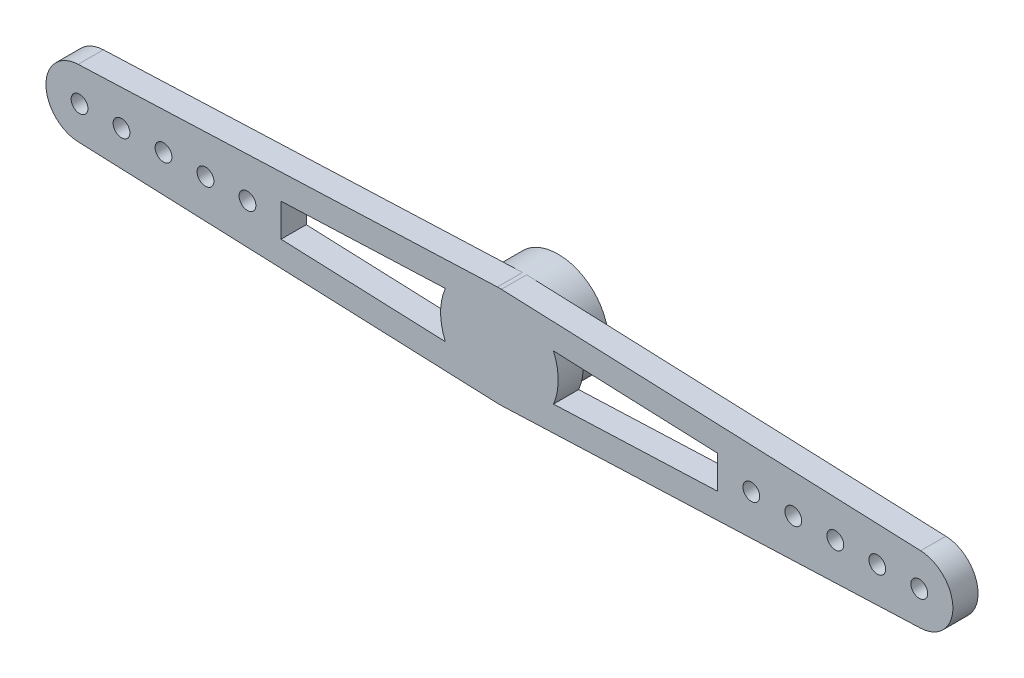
ISO-10303-21;
HEADER;
FILE_DESCRIPTION(('STEP AP214'),'2;1');
FILE_NAME('part.step','',(''),(''),'','','');
FILE_SCHEMA(('AUTOMOTIVE_DESIGN { 1 0 10303 214 1 1 1 1 }'));
ENDSEC;
DATA;
#1=APPLICATION_CONTEXT('core data for automotive mechanical design processes');
#2=APPLICATION_PROTOCOL_DEFINITION('international standard','automotive_design',2000,#1);
#3=PRODUCT_CONTEXT('',#1,'mechanical');
#4=PRODUCT('Part','Part','',(#3));
#5=PRODUCT_RELATED_PRODUCT_CATEGORY('part','',(#4));
#6=PRODUCT_DEFINITION_FORMATION('','',#4);
#7=PRODUCT_DEFINITION_CONTEXT('part definition',#1,'design');
#8=PRODUCT_DEFINITION('design','',#6,#7);
#9=PRODUCT_DEFINITION_SHAPE('','',#8);
#10=(LENGTH_UNIT() NAMED_UNIT(*) SI_UNIT(.MILLI.,.METRE.));
#11=(NAMED_UNIT(*) PLANE_ANGLE_UNIT() SI_UNIT($,.RADIAN.));
#12=(NAMED_UNIT(*) SI_UNIT($,.STERADIAN.) SOLID_ANGLE_UNIT());
#13=UNCERTAINTY_MEASURE_WITH_UNIT(LENGTH_MEASURE(1.E-05),#10,'distance_accuracy_value','');
#14=(GEOMETRIC_REPRESENTATION_CONTEXT(3) GLOBAL_UNCERTAINTY_ASSIGNED_CONTEXT((#13)) GLOBAL_UNIT_ASSIGNED_CONTEXT((#10,
#11,#12)) REPRESENTATION_CONTEXT('',''));
#15=CARTESIAN_POINT('',(0.,0.,0.));
#16=DIRECTION('',(0.,0.,1.));
#17=DIRECTION('',(1.,0.,0.));
#18=AXIS2_PLACEMENT_3D('',#15,#16,#17);
#19=CARTESIAN_POINT('',(0.,0.,0.));
#20=DIRECTION('',(0.,0.,1.));
#21=DIRECTION('',(1.,0.,0.));
#22=AXIS2_PLACEMENT_3D('',#19,#20,#21);
#23=PLANE('',#22);
#24=DIRECTION('',(0.,-1.,0.));
#25=VECTOR('',#24,1.);
#26=CARTESIAN_POINT('',(-13.,0.980784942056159,0.));
#27=LINE('',#26,#25);
#28=CARTESIAN_POINT('',(-13.,0.980784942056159,0.));
#29=VERTEX_POINT('',#28);
#30=CARTESIAN_POINT('',(-13.,-0.980784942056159,0.));
#31=VERTEX_POINT('',#30);
#32=EDGE_CURVE('E57',#29,#31,#27,.T.);
#33=ORIENTED_EDGE('',*,*,#32,.T.);
#34=DIRECTION('',(0.999199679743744,-0.04,0.));
#35=VECTOR('',#34,1.);
#36=CARTESIAN_POINT('',(-13.,-0.980784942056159,0.));
#37=LINE('',#36,#35);
#38=CARTESIAN_POINT('',(-3.21974682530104,-1.37230841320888,0.));
#39=VERTEX_POINT('',#38);
#40=EDGE_CURVE('E346',#31,#39,#37,.T.);
#41=ORIENTED_EDGE('',*,*,#40,.T.);
#42=CARTESIAN_POINT('',(0.,0.,0.));
#43=DIRECTION('',(0.,0.,-1.));
#44=DIRECTION('',(1.,0.,0.));
#45=AXIS2_PLACEMENT_3D('',#42,#43,#44);
#46=CIRCLE('',#45,3.5);
#47=CARTESIAN_POINT('',(-3.21974682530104,1.37230841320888,0.));
#48=VERTEX_POINT('',#47);
#49=EDGE_CURVE('E343',#39,#48,#46,.T.);
#50=ORIENTED_EDGE('',*,*,#49,.T.);
#51=DIRECTION('',(-0.999199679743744,-0.0399999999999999,0.));
#52=VECTOR('',#51,1.);
#53=CARTESIAN_POINT('',(-13.,0.980784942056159,0.));
#54=LINE('',#53,#52);
#55=EDGE_CURVE('E339',#48,#29,#54,.T.);
#56=ORIENTED_EDGE('',*,*,#55,.T.);
#57=EDGE_LOOP('',(#33,#41,#50,#56));
#58=FACE_BOUND('',#57,.T.);
#59=CARTESIAN_POINT('',(-15.,0.,0.));
#60=DIRECTION('',(0.,0.,1.));
#61=DIRECTION('',(1.,0.,0.));
#62=AXIS2_PLACEMENT_3D('',#59,#60,#61);
#63=CIRCLE('',#62,0.500000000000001);
#64=CARTESIAN_POINT('',(-14.5,0.,0.));
#65=VERTEX_POINT('',#64);
#66=EDGE_CURVE('E283',#65,#65,#63,.T.);
#67=ORIENTED_EDGE('',*,*,#66,.T.);
#68=EDGE_LOOP('',(#67));
#69=FACE_BOUND('',#68,.T.);
#70=CARTESIAN_POINT('',(-20.,0.,0.));
#71=DIRECTION('',(0.,0.,1.));
#72=DIRECTION('',(1.,0.,0.));
#73=AXIS2_PLACEMENT_3D('',#70,#71,#72);
#74=CIRCLE('',#73,0.499999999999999);
#75=CARTESIAN_POINT('',(-19.5,0.,0.));
#76=VERTEX_POINT('',#75);
#77=EDGE_CURVE('E259',#76,#76,#74,.T.);
#78=ORIENTED_EDGE('',*,*,#77,.T.);
#79=EDGE_LOOP('',(#78));
#80=FACE_BOUND('',#79,.T.);
#81=CARTESIAN_POINT('',(-25.,0.,0.));
#82=DIRECTION('',(0.,0.,1.));
#83=DIRECTION('',(1.,0.,0.));
#84=AXIS2_PLACEMENT_3D('',#81,#82,#83);
#85=CIRCLE('',#84,0.499999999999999);
#86=CARTESIAN_POINT('',(-24.5,0.,0.));
#87=VERTEX_POINT('',#86);
#88=EDGE_CURVE('E247',#87,#87,#85,.T.);
#89=ORIENTED_EDGE('',*,*,#88,.T.);
#90=EDGE_LOOP('',(#89));
#91=FACE_BOUND('',#90,.T.);
#92=CARTESIAN_POINT('',(-17.5,0.,0.));
#93=DIRECTION('',(0.,0.,1.));
#94=DIRECTION('',(1.,0.,0.));
#95=AXIS2_PLACEMENT_3D('',#92,#93,#94);
#96=CIRCLE('',#95,0.499999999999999);
#97=CARTESIAN_POINT('',(-17.,0.,0.));
#98=VERTEX_POINT('',#97);
#99=EDGE_CURVE('E241',#98,#98,#96,.T.);
#100=ORIENTED_EDGE('',*,*,#99,.T.);
#101=EDGE_LOOP('',(#100));
#102=FACE_BOUND('',#101,.T.);
#103=CARTESIAN_POINT('',(-22.5,0.,0.));
#104=DIRECTION('',(0.,0.,1.));
#105=DIRECTION('',(1.,0.,0.));
#106=AXIS2_PLACEMENT_3D('',#103,#104,#105);
#107=CIRCLE('',#106,0.499999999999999);
#108=CARTESIAN_POINT('',(-22.,0.,0.));
#109=VERTEX_POINT('',#108);
#110=EDGE_CURVE('E253',#109,#109,#107,.T.);
#111=ORIENTED_EDGE('',*,*,#110,.T.);
#112=EDGE_LOOP('',(#111));
#113=FACE_BOUND('',#112,.T.);
#114=DIRECTION('',(-0.999199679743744,-0.04,0.));
#115=VECTOR('',#114,1.);
#116=CARTESIAN_POINT('',(-25.08,1.99839935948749,0.));
#117=LINE('',#116,#115);
#118=CARTESIAN_POINT('',(-0.12,2.99759903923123,0.));
#119=VERTEX_POINT('',#118);
#120=CARTESIAN_POINT('',(-25.08,1.99839935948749,0.));
#121=VERTEX_POINT('',#120);
#122=EDGE_CURVE('E153',#119,#121,#117,.T.);
#123=ORIENTED_EDGE('',*,*,#122,.F.);
#124=CARTESIAN_POINT('',(0.,0.,0.));
#125=DIRECTION('',(0.,0.,1.));
#126=DIRECTION('',(1.,0.,0.));
#127=AXIS2_PLACEMENT_3D('',#124,#125,#126);
#128=CIRCLE('',#127,3.);
#129=CARTESIAN_POINT('',(-0.12,-2.99759903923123,0.));
#130=VERTEX_POINT('',#129);
#131=EDGE_CURVE('E149',#119,#130,#128,.T.);
#132=ORIENTED_EDGE('',*,*,#131,.T.);
#133=DIRECTION('',(0.999199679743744,-0.04,0.));
#134=VECTOR('',#133,1.);
#135=CARTESIAN_POINT('',(-25.08,-1.99839935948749,0.));
#136=LINE('',#135,#134);
#137=CARTESIAN_POINT('',(-25.08,-1.99839935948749,0.));
#138=VERTEX_POINT('',#137);
#139=EDGE_CURVE('E152',#138,#130,#136,.T.);
#140=ORIENTED_EDGE('',*,*,#139,.F.);
#141=CARTESIAN_POINT('',(-25.,0.,0.));
#142=DIRECTION('',(0.,0.,1.));
#143=DIRECTION('',(1.,0.,0.));
#144=AXIS2_PLACEMENT_3D('',#141,#142,#143);
#145=CIRCLE('',#144,2.);
#146=EDGE_CURVE('E171',#121,#138,#145,.T.);
#147=ORIENTED_EDGE('',*,*,#146,.F.);
#148=EDGE_LOOP('',(#123,#132,#140,#147));
#149=FACE_BOUND('',#148,.T.);
#150=ADVANCED_FACE('F34',(#58,#69,#80,#91,#102,#113,#149),#23,.F.);
#151=CARTESIAN_POINT('',(0.,0.,1.5));
#152=DIRECTION('',(0.,0.,1.));
#153=DIRECTION('',(1.,0.,0.));
#154=AXIS2_PLACEMENT_3D('',#151,#152,#153);
#155=PLANE('',#154);
#156=DIRECTION('',(-0.999199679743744,0.04,0.));
#157=VECTOR('',#156,1.);
#158=CARTESIAN_POINT('',(0.12,2.99759903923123,1.5));
#159=LINE('',#158,#157);
#160=CARTESIAN_POINT('',(25.08,1.99839935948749,1.5));
#161=VERTEX_POINT('',#160);
#162=CARTESIAN_POINT('',(0.12,2.99759903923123,1.5));
#163=VERTEX_POINT('',#162);
#164=EDGE_CURVE('E229',#161,#163,#159,.T.);
#165=ORIENTED_EDGE('',*,*,#164,.T.);
#166=CARTESIAN_POINT('',(0.,0.,1.5));
#167=DIRECTION('',(0.,0.,1.));
#168=DIRECTION('',(1.,0.,0.));
#169=AXIS2_PLACEMENT_3D('',#166,#167,#168);
#170=CIRCLE('',#169,3.);
#171=CARTESIAN_POINT('',(-0.12,2.99759903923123,1.5));
#172=VERTEX_POINT('',#171);
#173=EDGE_CURVE('E226',#163,#172,#170,.T.);
#174=ORIENTED_EDGE('',*,*,#173,.T.);
#175=DIRECTION('',(-0.999199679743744,-0.04,0.));
#176=VECTOR('',#175,1.);
#177=CARTESIAN_POINT('',(-25.08,1.99839935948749,1.5));
#178=LINE('',#177,#176);
#179=CARTESIAN_POINT('',(-25.08,1.99839935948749,1.5));
#180=VERTEX_POINT('',#179);
#181=EDGE_CURVE('E224',#172,#180,#178,.T.);
#182=ORIENTED_EDGE('',*,*,#181,.T.);
#183=CARTESIAN_POINT('',(-25.,0.,1.5));
#184=DIRECTION('',(0.,0.,1.));
#185=DIRECTION('',(1.,0.,0.));
#186=AXIS2_PLACEMENT_3D('',#183,#184,#185);
#187=CIRCLE('',#186,2.);
#188=CARTESIAN_POINT('',(-25.08,-1.99839935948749,1.5));
#189=VERTEX_POINT('',#188);
#190=EDGE_CURVE('E182',#180,#189,#187,.T.);
#191=ORIENTED_EDGE('',*,*,#190,.T.);
#192=DIRECTION('',(0.999199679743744,-0.04,0.));
#193=VECTOR('',#192,1.);
#194=CARTESIAN_POINT('',(-25.08,-1.99839935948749,1.5));
#195=LINE('',#194,#193);
#196=CARTESIAN_POINT('',(-0.12,-2.99759903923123,1.5));
#197=VERTEX_POINT('',#196);
#198=EDGE_CURVE('E178',#189,#197,#195,.T.);
#199=ORIENTED_EDGE('',*,*,#198,.T.);
#200=CARTESIAN_POINT('',(0.,0.,1.5));
#201=DIRECTION('',(0.,0.,1.));
#202=DIRECTION('',(1.,0.,0.));
#203=AXIS2_PLACEMENT_3D('',#200,#201,#202);
#204=CIRCLE('',#203,3.);
#205=CARTESIAN_POINT('',(0.12,-2.99759903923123,1.5));
#206=VERTEX_POINT('',#205);
#207=EDGE_CURVE('E170',#197,#206,#204,.T.);
#208=ORIENTED_EDGE('',*,*,#207,.T.);
#209=DIRECTION('',(0.999199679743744,0.04,0.));
#210=VECTOR('',#209,1.);
#211=CARTESIAN_POINT('',(25.08,-1.99839935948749,1.5));
#212=LINE('',#211,#210);
#213=CARTESIAN_POINT('',(25.08,-1.99839935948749,1.5));
#214=VERTEX_POINT('',#213);
#215=EDGE_CURVE('E237',#206,#214,#212,.T.);
#216=ORIENTED_EDGE('',*,*,#215,.T.);
#217=CARTESIAN_POINT('',(25.,0.,1.5));
#218=DIRECTION('',(0.,0.,1.));
#219=DIRECTION('',(1.,0.,0.));
#220=AXIS2_PLACEMENT_3D('',#217,#218,#219);
#221=CIRCLE('',#220,2.);
#222=EDGE_CURVE('E202',#214,#161,#221,.T.);
#223=ORIENTED_EDGE('',*,*,#222,.T.);
#224=EDGE_LOOP('',(#165,#174,#182,#191,#199,#208,#216,#223));
#225=FACE_BOUND('',#224,.T.);
#226=DIRECTION('',(0.999199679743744,0.04,0.));
#227=VECTOR('',#226,1.);
#228=CARTESIAN_POINT('',(13.,-0.980784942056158,1.5));
#229=LINE('',#228,#227);
#230=CARTESIAN_POINT('',(3.21974682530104,-1.37230841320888,1.5));
#231=VERTEX_POINT('',#230);
#232=CARTESIAN_POINT('',(13.,-0.980784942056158,1.5));
#233=VERTEX_POINT('',#232);
#234=EDGE_CURVE('E329',#231,#233,#229,.T.);
#235=ORIENTED_EDGE('',*,*,#234,.F.);
#236=CARTESIAN_POINT('',(0.,0.,1.5));
#237=DIRECTION('',(0.,0.,-1.));
#238=DIRECTION('',(1.,0.,0.));
#239=AXIS2_PLACEMENT_3D('',#236,#237,#238);
#240=CIRCLE('',#239,3.5);
#241=CARTESIAN_POINT('',(3.21974682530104,1.37230841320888,1.5));
#242=VERTEX_POINT('',#241);
#243=EDGE_CURVE('E314',#242,#231,#240,.T.);
#244=ORIENTED_EDGE('',*,*,#243,.F.);
#245=DIRECTION('',(-0.999199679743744,0.0400000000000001,0.));
#246=VECTOR('',#245,1.);
#247=CARTESIAN_POINT('',(3.21974682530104,1.37230841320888,1.5));
#248=LINE('',#247,#246);
#249=CARTESIAN_POINT('',(13.,0.980784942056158,1.5));
#250=VERTEX_POINT('',#249);
#251=EDGE_CURVE('E310',#250,#242,#248,.T.);
#252=ORIENTED_EDGE('',*,*,#251,.F.);
#253=DIRECTION('',(0.,1.,0.));
#254=VECTOR('',#253,1.);
#255=CARTESIAN_POINT('',(13.,-0.980784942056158,1.5));
#256=LINE('',#255,#254);
#257=EDGE_CURVE('E326',#233,#250,#256,.T.);
#258=ORIENTED_EDGE('',*,*,#257,.F.);
#259=EDGE_LOOP('',(#235,#244,#252,#258));
#260=FACE_BOUND('',#259,.T.);
#261=CARTESIAN_POINT('',(17.5,0.,1.5));
#262=DIRECTION('',(0.,0.,1.));
#263=DIRECTION('',(1.,0.,0.));
#264=AXIS2_PLACEMENT_3D('',#261,#262,#263);
#265=CIRCLE('',#264,0.499999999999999);
#266=CARTESIAN_POINT('',(18.,0.,1.5));
#267=VERTEX_POINT('',#266);
#268=EDGE_CURVE('E286',#267,#267,#265,.T.);
#269=ORIENTED_EDGE('',*,*,#268,.F.);
#270=EDGE_LOOP('',(#269));
#271=FACE_BOUND('',#270,.T.);
#272=CARTESIAN_POINT('',(25.,0.,1.5));
#273=DIRECTION('',(0.,0.,1.));
#274=DIRECTION('',(1.,0.,0.));
#275=AXIS2_PLACEMENT_3D('',#272,#273,#274);
#276=CIRCLE('',#275,0.499999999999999);
#277=CARTESIAN_POINT('',(25.5,0.,1.5));
#278=VERTEX_POINT('',#277);
#279=EDGE_CURVE('E274',#278,#278,#276,.T.);
#280=ORIENTED_EDGE('',*,*,#279,.F.);
#281=EDGE_LOOP('',(#280));
#282=FACE_BOUND('',#281,.T.);
#283=CARTESIAN_POINT('',(20.,0.,1.5));
#284=DIRECTION('',(0.,0.,1.));
#285=DIRECTION('',(1.,0.,0.));
#286=AXIS2_PLACEMENT_3D('',#283,#284,#285);
#287=CIRCLE('',#286,0.499999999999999);
#288=CARTESIAN_POINT('',(20.5,0.,1.5));
#289=VERTEX_POINT('',#288);
#290=EDGE_CURVE('E262',#289,#289,#287,.T.);
#291=ORIENTED_EDGE('',*,*,#290,.F.);
#292=EDGE_LOOP('',(#291));
#293=FACE_BOUND('',#292,.T.);
#294=CARTESIAN_POINT('',(22.5,0.,1.5));
#295=DIRECTION('',(0.,0.,1.));
#296=DIRECTION('',(1.,0.,0.));
#297=AXIS2_PLACEMENT_3D('',#294,#295,#296);
#298=CIRCLE('',#297,0.499999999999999);
#299=CARTESIAN_POINT('',(23.,0.,1.5));
#300=VERTEX_POINT('',#299);
#301=EDGE_CURVE('E268',#300,#300,#298,.T.);
#302=ORIENTED_EDGE('',*,*,#301,.F.);
#303=EDGE_LOOP('',(#302));
#304=FACE_BOUND('',#303,.T.);
#305=CARTESIAN_POINT('',(15.,0.,1.5));
#306=DIRECTION('',(0.,0.,1.));
#307=DIRECTION('',(1.,0.,0.));
#308=AXIS2_PLACEMENT_3D('',#305,#306,#307);
#309=CIRCLE('',#308,0.500000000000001);
#310=CARTESIAN_POINT('',(15.5,0.,1.5));
#311=VERTEX_POINT('',#310);
#312=EDGE_CURVE('E292',#311,#311,#309,.T.);
#313=ORIENTED_EDGE('',*,*,#312,.F.);
#314=EDGE_LOOP('',(#313));
#315=FACE_BOUND('',#314,.T.);
#316=DIRECTION('',(0.999199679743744,-0.04,0.));
#317=VECTOR('',#316,1.);
#318=CARTESIAN_POINT('',(-13.,-0.980784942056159,1.5));
#319=LINE('',#318,#317);
#320=CARTESIAN_POINT('',(-13.,-0.980784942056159,1.5));
#321=VERTEX_POINT('',#320);
#322=CARTESIAN_POINT('',(-3.21974682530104,-1.37230841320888,1.5));
#323=VERTEX_POINT('',#322);
#324=EDGE_CURVE('E353',#321,#323,#319,.T.);
#325=ORIENTED_EDGE('',*,*,#324,.F.);
#326=DIRECTION('',(0.,-1.,0.));
#327=VECTOR('',#326,1.);
#328=CARTESIAN_POINT('',(-13.,0.980784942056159,1.5));
#329=LINE('',#328,#327);
#330=CARTESIAN_POINT('',(-13.,0.980784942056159,1.5));
#331=VERTEX_POINT('',#330);
#332=EDGE_CURVE('E342',#331,#321,#329,.T.);
#333=ORIENTED_EDGE('',*,*,#332,.F.);
#334=DIRECTION('',(-0.999199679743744,-0.0399999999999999,0.));
#335=VECTOR('',#334,1.);
#336=CARTESIAN_POINT('',(-13.,0.980784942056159,1.5));
#337=LINE('',#336,#335);
#338=CARTESIAN_POINT('',(-3.21974682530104,1.37230841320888,1.5));
#339=VERTEX_POINT('',#338);
#340=EDGE_CURVE('E338',#339,#331,#337,.T.);
#341=ORIENTED_EDGE('',*,*,#340,.F.);
#342=CARTESIAN_POINT('',(0.,0.,1.5));
#343=DIRECTION('',(0.,0.,-1.));
#344=DIRECTION('',(1.,0.,0.));
#345=AXIS2_PLACEMENT_3D('',#342,#343,#344);
#346=CIRCLE('',#345,3.5);
#347=EDGE_CURVE('E351',#323,#339,#346,.T.);
#348=ORIENTED_EDGE('',*,*,#347,.F.);
#349=EDGE_LOOP('',(#325,#333,#341,#348));
#350=FACE_BOUND('',#349,.T.);
#351=CARTESIAN_POINT('',(-15.,0.,1.5));
#352=DIRECTION('',(0.,0.,1.));
#353=DIRECTION('',(1.,0.,0.));
#354=AXIS2_PLACEMENT_3D('',#351,#352,#353);
#355=CIRCLE('',#354,0.500000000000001);
#356=CARTESIAN_POINT('',(-14.5,0.,1.5));
#357=VERTEX_POINT('',#356);
#358=EDGE_CURVE('E280',#357,#357,#355,.T.);
#359=ORIENTED_EDGE('',*,*,#358,.F.);
#360=EDGE_LOOP('',(#359));
#361=FACE_BOUND('',#360,.T.);
#362=CARTESIAN_POINT('',(-20.,0.,1.5));
#363=DIRECTION('',(0.,0.,1.));
#364=DIRECTION('',(1.,0.,0.));
#365=AXIS2_PLACEMENT_3D('',#362,#363,#364);
#366=CIRCLE('',#365,0.499999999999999);
#367=CARTESIAN_POINT('',(-19.5,0.,1.5));
#368=VERTEX_POINT('',#367);
#369=EDGE_CURVE('E256',#368,#368,#366,.T.);
#370=ORIENTED_EDGE('',*,*,#369,.F.);
#371=EDGE_LOOP('',(#370));
#372=FACE_BOUND('',#371,.T.);
#373=CARTESIAN_POINT('',(-25.,0.,1.5));
#374=DIRECTION('',(0.,0.,1.));
#375=DIRECTION('',(1.,0.,0.));
#376=AXIS2_PLACEMENT_3D('',#373,#374,#375);
#377=CIRCLE('',#376,0.499999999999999);
#378=CARTESIAN_POINT('',(-24.5,0.,1.5));
#379=VERTEX_POINT('',#378);
#380=EDGE_CURVE('E244',#379,#379,#377,.T.);
#381=ORIENTED_EDGE('',*,*,#380,.F.);
#382=EDGE_LOOP('',(#381));
#383=FACE_BOUND('',#382,.T.);
#384=CARTESIAN_POINT('',(-17.5,0.,1.5));
#385=DIRECTION('',(0.,0.,1.));
#386=DIRECTION('',(1.,0.,0.));
#387=AXIS2_PLACEMENT_3D('',#384,#385,#386);
#388=CIRCLE('',#387,0.499999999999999);
#389=CARTESIAN_POINT('',(-17.,0.,1.5));
#390=VERTEX_POINT('',#389);
#391=EDGE_CURVE('E214',#390,#390,#388,.T.);
#392=ORIENTED_EDGE('',*,*,#391,.F.);
#393=EDGE_LOOP('',(#392));
#394=FACE_BOUND('',#393,.T.);
#395=CARTESIAN_POINT('',(-22.5,0.,1.5));
#396=DIRECTION('',(0.,0.,1.));
#397=DIRECTION('',(1.,0.,0.));
#398=AXIS2_PLACEMENT_3D('',#395,#396,#397);
#399=CIRCLE('',#398,0.499999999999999);
#400=CARTESIAN_POINT('',(-22.,0.,1.5));
#401=VERTEX_POINT('',#400);
#402=EDGE_CURVE('E250',#401,#401,#399,.T.);
#403=ORIENTED_EDGE('',*,*,#402,.F.);
#404=EDGE_LOOP('',(#403));
#405=FACE_BOUND('',#404,.T.);
#406=ADVANCED_FACE('F235',(#225,#260,#271,#282,#293,#304,#315,#350,#361,#372,#383,#394,#405),
#155,.T.);
#407=CARTESIAN_POINT('',(0.,0.,0.));
#408=DIRECTION('',(0.,0.,-1.));
#409=DIRECTION('',(1.,0.,0.));
#410=AXIS2_PLACEMENT_3D('',#407,#408,#409);
#411=CIRCLE('',#410,3.5);
#412=CARTESIAN_POINT('',(3.21974682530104,1.37230841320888,0.));
#413=VERTEX_POINT('',#412);
#414=CARTESIAN_POINT('',(3.21974682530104,-1.37230841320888,0.));
#415=VERTEX_POINT('',#414);
#416=EDGE_CURVE('E321',#413,#415,#411,.T.);
#417=ORIENTED_EDGE('',*,*,#416,.T.);
#418=DIRECTION('',(0.999199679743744,0.04,0.));
#419=VECTOR('',#418,1.);
#420=CARTESIAN_POINT('',(13.,-0.980784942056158,0.));
#421=LINE('',#420,#419);
#422=CARTESIAN_POINT('',(13.,-0.980784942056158,0.));
#423=VERTEX_POINT('',#422);
#424=EDGE_CURVE('E318',#415,#423,#421,.T.);
#425=ORIENTED_EDGE('',*,*,#424,.T.);
#426=DIRECTION('',(0.,1.,0.));
#427=VECTOR('',#426,1.);
#428=CARTESIAN_POINT('',(13.,-0.980784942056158,0.));
#429=LINE('',#428,#427);
#430=CARTESIAN_POINT('',(13.,0.980784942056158,0.));
#431=VERTEX_POINT('',#430);
#432=EDGE_CURVE('E315',#423,#431,#429,.T.);
#433=ORIENTED_EDGE('',*,*,#432,.T.);
#434=DIRECTION('',(-0.999199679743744,0.0400000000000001,0.));
#435=VECTOR('',#434,1.);
#436=CARTESIAN_POINT('',(3.21974682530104,1.37230841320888,0.));
#437=LINE('',#436,#435);
#438=EDGE_CURVE('E311',#431,#413,#437,.T.);
#439=ORIENTED_EDGE('',*,*,#438,.T.);
#440=EDGE_LOOP('',(#417,#425,#433,#439));
#441=FACE_BOUND('',#440,.T.);
#442=CARTESIAN_POINT('',(17.5,0.,0.));
#443=DIRECTION('',(0.,0.,1.));
#444=DIRECTION('',(1.,0.,0.));
#445=AXIS2_PLACEMENT_3D('',#442,#443,#444);
#446=CIRCLE('',#445,0.499999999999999);
#447=CARTESIAN_POINT('',(18.,0.,0.));
#448=VERTEX_POINT('',#447);
#449=EDGE_CURVE('E289',#448,#448,#446,.T.);
#450=ORIENTED_EDGE('',*,*,#449,.T.);
#451=EDGE_LOOP('',(#450));
#452=FACE_BOUND('',#451,.T.);
#453=CARTESIAN_POINT('',(25.,0.,0.));
#454=DIRECTION('',(0.,0.,1.));
#455=DIRECTION('',(1.,0.,0.));
#456=AXIS2_PLACEMENT_3D('',#453,#454,#455);
#457=CIRCLE('',#456,0.499999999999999);
#458=CARTESIAN_POINT('',(25.5,0.,0.));
#459=VERTEX_POINT('',#458);
#460=EDGE_CURVE('E277',#459,#459,#457,.T.);
#461=ORIENTED_EDGE('',*,*,#460,.T.);
#462=EDGE_LOOP('',(#461));
#463=FACE_BOUND('',#462,.T.);
#464=CARTESIAN_POINT('',(20.,0.,0.));
#465=DIRECTION('',(0.,0.,1.));
#466=DIRECTION('',(1.,0.,0.));
#467=AXIS2_PLACEMENT_3D('',#464,#465,#466);
#468=CIRCLE('',#467,0.499999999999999);
#469=CARTESIAN_POINT('',(20.5,0.,0.));
#470=VERTEX_POINT('',#469);
#471=EDGE_CURVE('E265',#470,#470,#468,.T.);
#472=ORIENTED_EDGE('',*,*,#471,.T.);
#473=EDGE_LOOP('',(#472));
#474=FACE_BOUND('',#473,.T.);
#475=DIRECTION('',(0.999199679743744,0.04,0.));
#476=VECTOR('',#475,1.);
#477=CARTESIAN_POINT('',(25.08,-1.99839935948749,0.));
#478=LINE('',#477,#476);
#479=CARTESIAN_POINT('',(0.12,-2.99759903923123,0.));
#480=VERTEX_POINT('',#479);
#481=CARTESIAN_POINT('',(25.08,-1.99839935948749,0.));
#482=VERTEX_POINT('',#481);
#483=EDGE_CURVE('E209',#480,#482,#478,.T.);
#484=ORIENTED_EDGE('',*,*,#483,.F.);
#485=CARTESIAN_POINT('',(0.12,2.99759903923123,0.));
#486=VERTEX_POINT('',#485);
#487=EDGE_CURVE('E158',#480,#486,#128,.T.);
#488=ORIENTED_EDGE('',*,*,#487,.T.);
#489=DIRECTION('',(-0.999199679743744,0.04,0.));
#490=VECTOR('',#489,1.);
#491=CARTESIAN_POINT('',(0.12,2.99759903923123,0.));
#492=LINE('',#491,#490);
#493=CARTESIAN_POINT('',(25.08,1.99839935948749,0.));
#494=VERTEX_POINT('',#493);
#495=EDGE_CURVE('E211',#494,#486,#492,.T.);
#496=ORIENTED_EDGE('',*,*,#495,.F.);
#497=CARTESIAN_POINT('',(25.,0.,0.));
#498=DIRECTION('',(0.,0.,1.));
#499=DIRECTION('',(1.,0.,0.));
#500=AXIS2_PLACEMENT_3D('',#497,#498,#499);
#501=CIRCLE('',#500,2.);
#502=EDGE_CURVE('E201',#482,#494,#501,.T.);
#503=ORIENTED_EDGE('',*,*,#502,.F.);
#504=EDGE_LOOP('',(#484,#488,#496,#503));
#505=FACE_BOUND('',#504,.T.);
#506=CARTESIAN_POINT('',(22.5,0.,0.));
#507=DIRECTION('',(0.,0.,1.));
#508=DIRECTION('',(1.,0.,0.));
#509=AXIS2_PLACEMENT_3D('',#506,#507,#508);
#510=CIRCLE('',#509,0.499999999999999);
#511=CARTESIAN_POINT('',(23.,0.,0.));
#512=VERTEX_POINT('',#511);
#513=EDGE_CURVE('E271',#512,#512,#510,.T.);
#514=ORIENTED_EDGE('',*,*,#513,.T.);
#515=EDGE_LOOP('',(#514));
#516=FACE_BOUND('',#515,.T.);
#517=CARTESIAN_POINT('',(15.,0.,0.));
#518=DIRECTION('',(0.,0.,1.));
#519=DIRECTION('',(1.,0.,0.));
#520=AXIS2_PLACEMENT_3D('',#517,#518,#519);
#521=CIRCLE('',#520,0.500000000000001);
#522=CARTESIAN_POINT('',(15.5,0.,0.));
#523=VERTEX_POINT('',#522);
#524=EDGE_CURVE('E295',#523,#523,#521,.T.);
#525=ORIENTED_EDGE('',*,*,#524,.T.);
#526=EDGE_LOOP('',(#525));
#527=FACE_BOUND('',#526,.T.);
#528=ADVANCED_FACE('F207',(#441,#452,#463,#474,#505,#516,#527),#23,.F.);
#529=CARTESIAN_POINT('',(25.08,-1.99839935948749,1.5));
#530=DIRECTION('',(-0.04,0.999199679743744,0.));
#531=DIRECTION('',(-0.999199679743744,-0.04,0.));
#532=AXIS2_PLACEMENT_3D('',#529,#530,#531);
#533=PLANE('',#532);
#534=ORIENTED_EDGE('',*,*,#483,.T.);
#535=DIRECTION('',(0.,0.,-1.));
#536=VECTOR('',#535,1.);
#537=CARTESIAN_POINT('',(25.08,-1.99839935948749,1.5));
#538=LINE('',#537,#536);
#539=EDGE_CURVE('E42',#214,#482,#538,.T.);
#540=ORIENTED_EDGE('',*,*,#539,.F.);
#541=ORIENTED_EDGE('',*,*,#215,.F.);
#542=DIRECTION('',(0.,0.,-1.));
#543=VECTOR('',#542,1.);
#544=CARTESIAN_POINT('',(0.12,-2.99759903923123,1.5));
#545=LINE('',#544,#543);
#546=EDGE_CURVE('E11',#206,#480,#545,.T.);
#547=ORIENTED_EDGE('',*,*,#546,.T.);
#548=EDGE_LOOP('',(#534,#540,#541,#547));
#549=FACE_BOUND('',#548,.T.);
#550=ADVANCED_FACE('F36',(#549),#533,.F.);
#551=CARTESIAN_POINT('',(25.,0.,1.5));
#552=DIRECTION('',(0.,0.,-1.));
#553=DIRECTION('',(-1.,0.,0.));
#554=AXIS2_PLACEMENT_3D('',#551,#552,#553);
#555=CYLINDRICAL_SURFACE('',#554,2.);
#556=ORIENTED_EDGE('',*,*,#502,.T.);
#557=DIRECTION('',(0.,0.,-1.));
#558=VECTOR('',#557,1.);
#559=CARTESIAN_POINT('',(25.08,1.99839935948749,1.5));
#560=LINE('',#559,#558);
#561=EDGE_CURVE('E192',#161,#494,#560,.T.);
#562=ORIENTED_EDGE('',*,*,#561,.F.);
#563=ORIENTED_EDGE('',*,*,#222,.F.);
#564=ORIENTED_EDGE('',*,*,#539,.T.);
#565=EDGE_LOOP('',(#556,#562,#563,#564));
#566=FACE_BOUND('',#565,.T.);
#567=ADVANCED_FACE('F199',(#566),#555,.T.);
#568=CARTESIAN_POINT('',(0.12,2.99759903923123,1.5));
#569=DIRECTION('',(-0.04,-0.999199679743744,0.));
#570=DIRECTION('',(0.999199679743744,-0.04,0.));
#571=AXIS2_PLACEMENT_3D('',#568,#569,#570);
#572=PLANE('',#571);
#573=ORIENTED_EDGE('',*,*,#495,.T.);
#574=DIRECTION('',(0.,0.,-1.));
#575=VECTOR('',#574,1.);
#576=CARTESIAN_POINT('',(0.12,2.99759903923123,1.5));
#577=LINE('',#576,#575);
#578=EDGE_CURVE('E190',#163,#486,#577,.T.);
#579=ORIENTED_EDGE('',*,*,#578,.F.);
#580=ORIENTED_EDGE('',*,*,#164,.F.);
#581=ORIENTED_EDGE('',*,*,#561,.T.);
#582=EDGE_LOOP('',(#573,#579,#580,#581));
#583=FACE_BOUND('',#582,.T.);
#584=ADVANCED_FACE('F380',(#583),#572,.F.);
#585=CARTESIAN_POINT('',(0.,0.,1.5));
#586=DIRECTION('',(0.,0.,-1.));
#587=DIRECTION('',(-1.,0.,0.));
#588=AXIS2_PLACEMENT_3D('',#585,#586,#587);
#589=CYLINDRICAL_SURFACE('',#588,3.);
#590=ORIENTED_EDGE('',*,*,#578,.T.);
#591=ORIENTED_EDGE('',*,*,#487,.F.);
#592=ORIENTED_EDGE('',*,*,#546,.F.);
#593=ORIENTED_EDGE('',*,*,#207,.F.);
#594=DIRECTION('',(0.,0.,-1.));
#595=VECTOR('',#594,1.);
#596=CARTESIAN_POINT('',(-0.12,-2.99759903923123,1.5));
#597=LINE('',#596,#595);
#598=EDGE_CURVE('E166',#197,#130,#597,.T.);
#599=ORIENTED_EDGE('',*,*,#598,.T.);
#600=ORIENTED_EDGE('',*,*,#131,.F.);
#601=DIRECTION('',(0.,0.,-1.));
#602=VECTOR('',#601,1.);
#603=CARTESIAN_POINT('',(-0.12,2.99759903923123,1.5));
#604=LINE('',#603,#602);
#605=EDGE_CURVE('E188',#172,#119,#604,.T.);
#606=ORIENTED_EDGE('',*,*,#605,.F.);
#607=ORIENTED_EDGE('',*,*,#173,.F.);
#608=EDGE_LOOP('',(#590,#591,#592,#593,#599,#600,#606,#607));
#609=FACE_BOUND('',#608,.T.);
#610=CARTESIAN_POINT('',(0.,0.,-2.));
#611=DIRECTION('',(0.,0.,-1.));
#612=DIRECTION('',(-1.,0.,0.));
#613=AXIS2_PLACEMENT_3D('',#610,#611,#612);
#614=CIRCLE('',#613,3.);
#615=CARTESIAN_POINT('',(-3.,0.,-2.));
#616=VERTEX_POINT('',#615);
#617=EDGE_CURVE('E159',#616,#616,#614,.T.);
#618=ORIENTED_EDGE('',*,*,#617,.F.);
#619=EDGE_LOOP('',(#618));
#620=FACE_BOUND('',#619,.T.);
#621=ADVANCED_FACE('F174',(#609,#620),#589,.T.);
#622=CARTESIAN_POINT('',(-25.08,1.99839935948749,1.5));
#623=DIRECTION('',(0.04,-0.999199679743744,0.));
#624=DIRECTION('',(0.999199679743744,0.04,0.));
#625=AXIS2_PLACEMENT_3D('',#622,#623,#624);
#626=PLANE('',#625);
#627=ORIENTED_EDGE('',*,*,#122,.T.);
#628=DIRECTION('',(0.,0.,-1.));
#629=VECTOR('',#628,1.);
#630=CARTESIAN_POINT('',(-25.08,1.99839935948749,1.5));
#631=LINE('',#630,#629);
#632=EDGE_CURVE('E180',#180,#121,#631,.T.);
#633=ORIENTED_EDGE('',*,*,#632,.F.);
#634=ORIENTED_EDGE('',*,*,#181,.F.);
#635=ORIENTED_EDGE('',*,*,#605,.T.);
#636=EDGE_LOOP('',(#627,#633,#634,#635));
#637=FACE_BOUND('',#636,.T.);
#638=ADVANCED_FACE('F223',(#637),#626,.F.);
#639=CARTESIAN_POINT('',(-25.,0.,1.5));
#640=DIRECTION('',(0.,0.,-1.));
#641=DIRECTION('',(-1.,0.,0.));
#642=AXIS2_PLACEMENT_3D('',#639,#640,#641);
#643=CYLINDRICAL_SURFACE('',#642,2.);
#644=ORIENTED_EDGE('',*,*,#146,.T.);
#645=DIRECTION('',(0.,0.,-1.));
#646=VECTOR('',#645,1.);
#647=CARTESIAN_POINT('',(-25.08,-1.99839935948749,1.5));
#648=LINE('',#647,#646);
#649=EDGE_CURVE('E169',#189,#138,#648,.T.);
#650=ORIENTED_EDGE('',*,*,#649,.F.);
#651=ORIENTED_EDGE('',*,*,#190,.F.);
#652=ORIENTED_EDGE('',*,*,#632,.T.);
#653=EDGE_LOOP('',(#644,#650,#651,#652));
#654=FACE_BOUND('',#653,.T.);
#655=ADVANCED_FACE('F218',(#654),#643,.T.);
#656=CARTESIAN_POINT('',(-25.08,-1.99839935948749,1.5));
#657=DIRECTION('',(0.04,0.999199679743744,0.));
#658=DIRECTION('',(-0.999199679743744,0.04,0.));
#659=AXIS2_PLACEMENT_3D('',#656,#657,#658);
#660=PLANE('',#659);
#661=ORIENTED_EDGE('',*,*,#139,.T.);
#662=ORIENTED_EDGE('',*,*,#598,.F.);
#663=ORIENTED_EDGE('',*,*,#198,.F.);
#664=ORIENTED_EDGE('',*,*,#649,.T.);
#665=EDGE_LOOP('',(#661,#662,#663,#664));
#666=FACE_BOUND('',#665,.T.);
#667=ADVANCED_FACE('F164',(#666),#660,.F.);
#668=CARTESIAN_POINT('',(-17.5,0.,1.5));
#669=DIRECTION('',(0.,0.,-1.));
#670=DIRECTION('',(-1.,0.,0.));
#671=AXIS2_PLACEMENT_3D('',#668,#669,#670);
#672=CYLINDRICAL_SURFACE('',#671,0.499999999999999);
#673=ORIENTED_EDGE('',*,*,#391,.T.);
#674=EDGE_LOOP('',(#673));
#675=FACE_BOUND('',#674,.T.);
#676=ORIENTED_EDGE('',*,*,#99,.F.);
#677=EDGE_LOOP('',(#676));
#678=FACE_BOUND('',#677,.T.);
#679=ADVANCED_FACE('F434',(#675,#678),#672,.F.);
#680=CARTESIAN_POINT('',(-25.,0.,1.5));
#681=DIRECTION('',(0.,0.,-1.));
#682=DIRECTION('',(-1.,0.,0.));
#683=AXIS2_PLACEMENT_3D('',#680,#681,#682);
#684=CYLINDRICAL_SURFACE('',#683,0.499999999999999);
#685=ORIENTED_EDGE('',*,*,#380,.T.);
#686=EDGE_LOOP('',(#685));
#687=FACE_BOUND('',#686,.T.);
#688=ORIENTED_EDGE('',*,*,#88,.F.);
#689=EDGE_LOOP('',(#688));
#690=FACE_BOUND('',#689,.T.);
#691=ADVANCED_FACE('F430',(#687,#690),#684,.F.);
#692=CARTESIAN_POINT('',(-22.5,0.,1.5));
#693=DIRECTION('',(0.,0.,-1.));
#694=DIRECTION('',(-1.,0.,0.));
#695=AXIS2_PLACEMENT_3D('',#692,#693,#694);
#696=CYLINDRICAL_SURFACE('',#695,0.499999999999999);
#697=ORIENTED_EDGE('',*,*,#402,.T.);
#698=EDGE_LOOP('',(#697));
#699=FACE_BOUND('',#698,.T.);
#700=ORIENTED_EDGE('',*,*,#110,.F.);
#701=EDGE_LOOP('',(#700));
#702=FACE_BOUND('',#701,.T.);
#703=ADVANCED_FACE('F423',(#699,#702),#696,.F.);
#704=CARTESIAN_POINT('',(-20.,0.,1.5));
#705=DIRECTION('',(0.,0.,-1.));
#706=DIRECTION('',(-1.,0.,0.));
#707=AXIS2_PLACEMENT_3D('',#704,#705,#706);
#708=CYLINDRICAL_SURFACE('',#707,0.499999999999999);
#709=ORIENTED_EDGE('',*,*,#369,.T.);
#710=EDGE_LOOP('',(#709));
#711=FACE_BOUND('',#710,.T.);
#712=ORIENTED_EDGE('',*,*,#77,.F.);
#713=EDGE_LOOP('',(#712));
#714=FACE_BOUND('',#713,.T.);
#715=ADVANCED_FACE('F413',(#711,#714),#708,.F.);
#716=CARTESIAN_POINT('',(20.,0.,1.5));
#717=DIRECTION('',(0.,0.,-1.));
#718=DIRECTION('',(-1.,0.,0.));
#719=AXIS2_PLACEMENT_3D('',#716,#717,#718);
#720=CYLINDRICAL_SURFACE('',#719,0.499999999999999);
#721=ORIENTED_EDGE('',*,*,#290,.T.);
#722=EDGE_LOOP('',(#721));
#723=FACE_BOUND('',#722,.T.);
#724=ORIENTED_EDGE('',*,*,#471,.F.);
#725=EDGE_LOOP('',(#724));
#726=FACE_BOUND('',#725,.T.);
#727=ADVANCED_FACE('F410',(#723,#726),#720,.F.);
#728=CARTESIAN_POINT('',(22.5,0.,1.5));
#729=DIRECTION('',(0.,0.,-1.));
#730=DIRECTION('',(-1.,0.,0.));
#731=AXIS2_PLACEMENT_3D('',#728,#729,#730);
#732=CYLINDRICAL_SURFACE('',#731,0.499999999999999);
#733=ORIENTED_EDGE('',*,*,#301,.T.);
#734=EDGE_LOOP('',(#733));
#735=FACE_BOUND('',#734,.T.);
#736=ORIENTED_EDGE('',*,*,#513,.F.);
#737=EDGE_LOOP('',(#736));
#738=FACE_BOUND('',#737,.T.);
#739=ADVANCED_FACE('F412',(#735,#738),#732,.F.);
#740=CARTESIAN_POINT('',(25.,0.,1.5));
#741=DIRECTION('',(0.,0.,-1.));
#742=DIRECTION('',(-1.,0.,0.));
#743=AXIS2_PLACEMENT_3D('',#740,#741,#742);
#744=CYLINDRICAL_SURFACE('',#743,0.499999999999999);
#745=ORIENTED_EDGE('',*,*,#279,.T.);
#746=EDGE_LOOP('',(#745));
#747=FACE_BOUND('',#746,.T.);
#748=ORIENTED_EDGE('',*,*,#460,.F.);
#749=EDGE_LOOP('',(#748));
#750=FACE_BOUND('',#749,.T.);
#751=ADVANCED_FACE('F420',(#747,#750),#744,.F.);
#752=CARTESIAN_POINT('',(-15.,0.,1.5));
#753=DIRECTION('',(0.,0.,-1.));
#754=DIRECTION('',(-1.,0.,0.));
#755=AXIS2_PLACEMENT_3D('',#752,#753,#754);
#756=CYLINDRICAL_SURFACE('',#755,0.500000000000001);
#757=ORIENTED_EDGE('',*,*,#358,.T.);
#758=EDGE_LOOP('',(#757));
#759=FACE_BOUND('',#758,.T.);
#760=ORIENTED_EDGE('',*,*,#66,.F.);
#761=EDGE_LOOP('',(#760));
#762=FACE_BOUND('',#761,.T.);
#763=ADVANCED_FACE('F532',(#759,#762),#756,.F.);
#764=CARTESIAN_POINT('',(17.5,0.,1.5));
#765=DIRECTION('',(0.,0.,-1.));
#766=DIRECTION('',(-1.,0.,0.));
#767=AXIS2_PLACEMENT_3D('',#764,#765,#766);
#768=CYLINDRICAL_SURFACE('',#767,0.499999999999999);
#769=ORIENTED_EDGE('',*,*,#268,.T.);
#770=EDGE_LOOP('',(#769));
#771=FACE_BOUND('',#770,.T.);
#772=ORIENTED_EDGE('',*,*,#449,.F.);
#773=EDGE_LOOP('',(#772));
#774=FACE_BOUND('',#773,.T.);
#775=ADVANCED_FACE('F528',(#771,#774),#768,.F.);
#776=CARTESIAN_POINT('',(15.,0.,1.5));
#777=DIRECTION('',(0.,0.,-1.));
#778=DIRECTION('',(-1.,0.,0.));
#779=AXIS2_PLACEMENT_3D('',#776,#777,#778);
#780=CYLINDRICAL_SURFACE('',#779,0.500000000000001);
#781=ORIENTED_EDGE('',*,*,#312,.T.);
#782=EDGE_LOOP('',(#781));
#783=FACE_BOUND('',#782,.T.);
#784=ORIENTED_EDGE('',*,*,#524,.F.);
#785=EDGE_LOOP('',(#784));
#786=FACE_BOUND('',#785,.T.);
#787=ADVANCED_FACE('F524',(#783,#786),#780,.F.);
#788=CARTESIAN_POINT('',(0.,0.,1.5));
#789=DIRECTION('',(0.,0.,-1.));
#790=DIRECTION('',(-1.,0.,0.));
#791=AXIS2_PLACEMENT_3D('',#788,#789,#790);
#792=CYLINDRICAL_SURFACE('',#791,3.5);
#793=ORIENTED_EDGE('',*,*,#416,.F.);
#794=DIRECTION('',(0.,0.,-1.));
#795=VECTOR('',#794,1.);
#796=CARTESIAN_POINT('',(3.21974682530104,1.37230841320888,1.5));
#797=LINE('',#796,#795);
#798=EDGE_CURVE('E307',#242,#413,#797,.T.);
#799=ORIENTED_EDGE('',*,*,#798,.F.);
#800=ORIENTED_EDGE('',*,*,#243,.T.);
#801=DIRECTION('',(0.,0.,-1.));
#802=VECTOR('',#801,1.);
#803=CARTESIAN_POINT('',(3.21974682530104,-1.37230841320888,1.5));
#804=LINE('',#803,#802);
#805=EDGE_CURVE('E298',#231,#415,#804,.T.);
#806=ORIENTED_EDGE('',*,*,#805,.T.);
#807=EDGE_LOOP('',(#793,#799,#800,#806));
#808=FACE_BOUND('',#807,.T.);
#809=ADVANCED_FACE('F520',(#808),#792,.T.);
#810=CARTESIAN_POINT('',(13.,-0.980784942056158,1.5));
#811=DIRECTION('',(-0.04,0.999199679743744,0.));
#812=DIRECTION('',(-0.999199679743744,-0.04,0.));
#813=AXIS2_PLACEMENT_3D('',#810,#811,#812);
#814=PLANE('',#813);
#815=ORIENTED_EDGE('',*,*,#424,.F.);
#816=ORIENTED_EDGE('',*,*,#805,.F.);
#817=ORIENTED_EDGE('',*,*,#234,.T.);
#818=DIRECTION('',(0.,0.,-1.));
#819=VECTOR('',#818,1.);
#820=CARTESIAN_POINT('',(13.,-0.980784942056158,1.5));
#821=LINE('',#820,#819);
#822=EDGE_CURVE('E303',#233,#423,#821,.T.);
#823=ORIENTED_EDGE('',*,*,#822,.T.);
#824=EDGE_LOOP('',(#815,#816,#817,#823));
#825=FACE_BOUND('',#824,.T.);
#826=ADVANCED_FACE('F516',(#825),#814,.T.);
#827=CARTESIAN_POINT('',(13.,-0.980784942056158,1.5));
#828=DIRECTION('',(-1.,0.,0.));
#829=DIRECTION('',(0.,-1.,0.));
#830=AXIS2_PLACEMENT_3D('',#827,#828,#829);
#831=PLANE('',#830);
#832=ORIENTED_EDGE('',*,*,#432,.F.);
#833=ORIENTED_EDGE('',*,*,#822,.F.);
#834=ORIENTED_EDGE('',*,*,#257,.T.);
#835=DIRECTION('',(0.,0.,-1.));
#836=VECTOR('',#835,1.);
#837=CARTESIAN_POINT('',(13.,0.980784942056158,1.5));
#838=LINE('',#837,#836);
#839=EDGE_CURVE('E305',#250,#431,#838,.T.);
#840=ORIENTED_EDGE('',*,*,#839,.T.);
#841=EDGE_LOOP('',(#832,#833,#834,#840));
#842=FACE_BOUND('',#841,.T.);
#843=ADVANCED_FACE('F512',(#842),#831,.T.);
#844=CARTESIAN_POINT('',(3.21974682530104,1.37230841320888,1.5));
#845=DIRECTION('',(-0.0400000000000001,-0.999199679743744,0.));
#846=DIRECTION('',(0.999199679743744,-0.0400000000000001,0.));
#847=AXIS2_PLACEMENT_3D('',#844,#845,#846);
#848=PLANE('',#847);
#849=ORIENTED_EDGE('',*,*,#438,.F.);
#850=ORIENTED_EDGE('',*,*,#839,.F.);
#851=ORIENTED_EDGE('',*,*,#251,.T.);
#852=ORIENTED_EDGE('',*,*,#798,.T.);
#853=EDGE_LOOP('',(#849,#850,#851,#852));
#854=FACE_BOUND('',#853,.T.);
#855=ADVANCED_FACE('F509',(#854),#848,.T.);
#856=CARTESIAN_POINT('',(-13.,0.980784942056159,1.5));
#857=DIRECTION('',(1.,0.,0.));
#858=DIRECTION('',(0.,0.,-1.));
#859=AXIS2_PLACEMENT_3D('',#856,#857,#858);
#860=PLANE('',#859);
#861=ORIENTED_EDGE('',*,*,#32,.F.);
#862=DIRECTION('',(0.,0.,-1.));
#863=VECTOR('',#862,1.);
#864=CARTESIAN_POINT('',(-13.,0.980784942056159,1.5));
#865=LINE('',#864,#863);
#866=EDGE_CURVE('E336',#331,#29,#865,.T.);
#867=ORIENTED_EDGE('',*,*,#866,.F.);
#868=ORIENTED_EDGE('',*,*,#332,.T.);
#869=DIRECTION('',(0.,0.,-1.));
#870=VECTOR('',#869,1.);
#871=CARTESIAN_POINT('',(-13.,-0.980784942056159,1.5));
#872=LINE('',#871,#870);
#873=EDGE_CURVE('E324',#321,#31,#872,.T.);
#874=ORIENTED_EDGE('',*,*,#873,.T.);
#875=EDGE_LOOP('',(#861,#867,#868,#874));
#876=FACE_BOUND('',#875,.T.);
#877=ADVANCED_FACE('F505',(#876),#860,.T.);
#878=CARTESIAN_POINT('',(-13.,-0.980784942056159,1.5));
#879=DIRECTION('',(0.04,0.999199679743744,0.));
#880=DIRECTION('',(-0.999199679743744,0.04,0.));
#881=AXIS2_PLACEMENT_3D('',#878,#879,#880);
#882=PLANE('',#881);
#883=ORIENTED_EDGE('',*,*,#40,.F.);
#884=ORIENTED_EDGE('',*,*,#873,.F.);
#885=ORIENTED_EDGE('',*,*,#324,.T.);
#886=DIRECTION('',(0.,0.,-1.));
#887=VECTOR('',#886,1.);
#888=CARTESIAN_POINT('',(-3.21974682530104,-1.37230841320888,1.5));
#889=LINE('',#888,#887);
#890=EDGE_CURVE('E333',#323,#39,#889,.T.);
#891=ORIENTED_EDGE('',*,*,#890,.T.);
#892=EDGE_LOOP('',(#883,#884,#885,#891));
#893=FACE_BOUND('',#892,.T.);
#894=ADVANCED_FACE('F501',(#893),#882,.T.);
#895=CARTESIAN_POINT('',(0.,0.,1.5));
#896=DIRECTION('',(0.,0.,-1.));
#897=DIRECTION('',(-1.,0.,0.));
#898=AXIS2_PLACEMENT_3D('',#895,#896,#897);
#899=CYLINDRICAL_SURFACE('',#898,3.5);
#900=ORIENTED_EDGE('',*,*,#49,.F.);
#901=ORIENTED_EDGE('',*,*,#890,.F.);
#902=ORIENTED_EDGE('',*,*,#347,.T.);
#903=DIRECTION('',(0.,0.,-1.));
#904=VECTOR('',#903,1.);
#905=CARTESIAN_POINT('',(-3.21974682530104,1.37230841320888,1.5));
#906=LINE('',#905,#904);
#907=EDGE_CURVE('E49',#339,#48,#906,.T.);
#908=ORIENTED_EDGE('',*,*,#907,.T.);
#909=EDGE_LOOP('',(#900,#901,#902,#908));
#910=FACE_BOUND('',#909,.T.);
#911=ADVANCED_FACE('F498',(#910),#899,.T.);
#912=CARTESIAN_POINT('',(-13.,0.980784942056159,1.5));
#913=DIRECTION('',(0.0399999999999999,-0.999199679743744,0.));
#914=DIRECTION('',(0.999199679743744,0.0399999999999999,0.));
#915=AXIS2_PLACEMENT_3D('',#912,#913,#914);
#916=PLANE('',#915);
#917=ORIENTED_EDGE('',*,*,#55,.F.);
#918=ORIENTED_EDGE('',*,*,#907,.F.);
#919=ORIENTED_EDGE('',*,*,#340,.T.);
#920=ORIENTED_EDGE('',*,*,#866,.T.);
#921=EDGE_LOOP('',(#917,#918,#919,#920));
#922=FACE_BOUND('',#921,.T.);
#923=ADVANCED_FACE('F376',(#922),#916,.T.);
#924=CARTESIAN_POINT('',(0.,0.,-2.));
#925=DIRECTION('',(0.,0.,-1.));
#926=DIRECTION('',(-1.,0.,0.));
#927=AXIS2_PLACEMENT_3D('',#924,#925,#926);
#928=PLANE('',#927);
#929=CARTESIAN_POINT('',(0.,0.,-2.));
#930=DIRECTION('',(0.,0.,-1.));
#931=DIRECTION('',(-1.,0.,0.));
#932=AXIS2_PLACEMENT_3D('',#929,#930,#931);
#933=CIRCLE('',#932,2.);
#934=CARTESIAN_POINT('',(-2.,0.,-2.));
#935=VERTEX_POINT('',#934);
#936=EDGE_CURVE('E359',#935,#935,#933,.T.);
#937=ORIENTED_EDGE('',*,*,#936,.F.);
#938=EDGE_LOOP('',(#937));
#939=FACE_BOUND('',#938,.T.);
#940=ORIENTED_EDGE('',*,*,#617,.T.);
#941=EDGE_LOOP('',(#940));
#942=FACE_BOUND('',#941,.T.);
#943=ADVANCED_FACE('F370',(#939,#942),#928,.T.);
#944=CARTESIAN_POINT('',(0.,0.,0.5));
#945=DIRECTION('',(0.,0.,-1.));
#946=DIRECTION('',(-1.,0.,0.));
#947=AXIS2_PLACEMENT_3D('',#944,#945,#946);
#948=CYLINDRICAL_SURFACE('',#947,2.);
#949=CARTESIAN_POINT('',(0.,0.,0.5));
#950=DIRECTION('',(0.,0.,-1.));
#951=DIRECTION('',(-1.,0.,0.));
#952=AXIS2_PLACEMENT_3D('',#949,#950,#951);
#953=CIRCLE('',#952,2.);
#954=CARTESIAN_POINT('',(-2.,0.,0.5));
#955=VERTEX_POINT('',#954);
#956=EDGE_CURVE('E358',#955,#955,#953,.T.);
#957=ORIENTED_EDGE('',*,*,#956,.F.);
#958=EDGE_LOOP('',(#957));
#959=FACE_BOUND('',#958,.T.);
#960=ORIENTED_EDGE('',*,*,#936,.T.);
#961=EDGE_LOOP('',(#960));
#962=FACE_BOUND('',#961,.T.);
#963=ADVANCED_FACE('F367',(#959,#962),#948,.F.);
#964=CARTESIAN_POINT('',(0.,0.,0.5));
#965=DIRECTION('',(0.,0.,-1.));
#966=DIRECTION('',(-1.,0.,0.));
#967=AXIS2_PLACEMENT_3D('',#964,#965,#966);
#968=PLANE('',#967);
#969=ORIENTED_EDGE('',*,*,#956,.T.);
#970=EDGE_LOOP('',(#969));
#971=FACE_BOUND('',#970,.T.);
#972=ADVANCED_FACE('F365',(#971),#968,.T.);
#973=CLOSED_SHELL('',(#150,#406,#528,#550,#567,#584,#621,#638,#655,#667,#679,#691,#703,#715,
#727,#739,#751,#763,#775,#787,#809,#826,#843,#855,#877,#894,#911,#923,#943,#963,#972));
#974=MANIFOLD_SOLID_BREP('B2',#973);
#975=ADVANCED_BREP_SHAPE_REPRESENTATION('',(#18,#974),#14);
#976=SHAPE_DEFINITION_REPRESENTATION(#9,#975);
ENDSEC;
END-ISO-10303-21;
